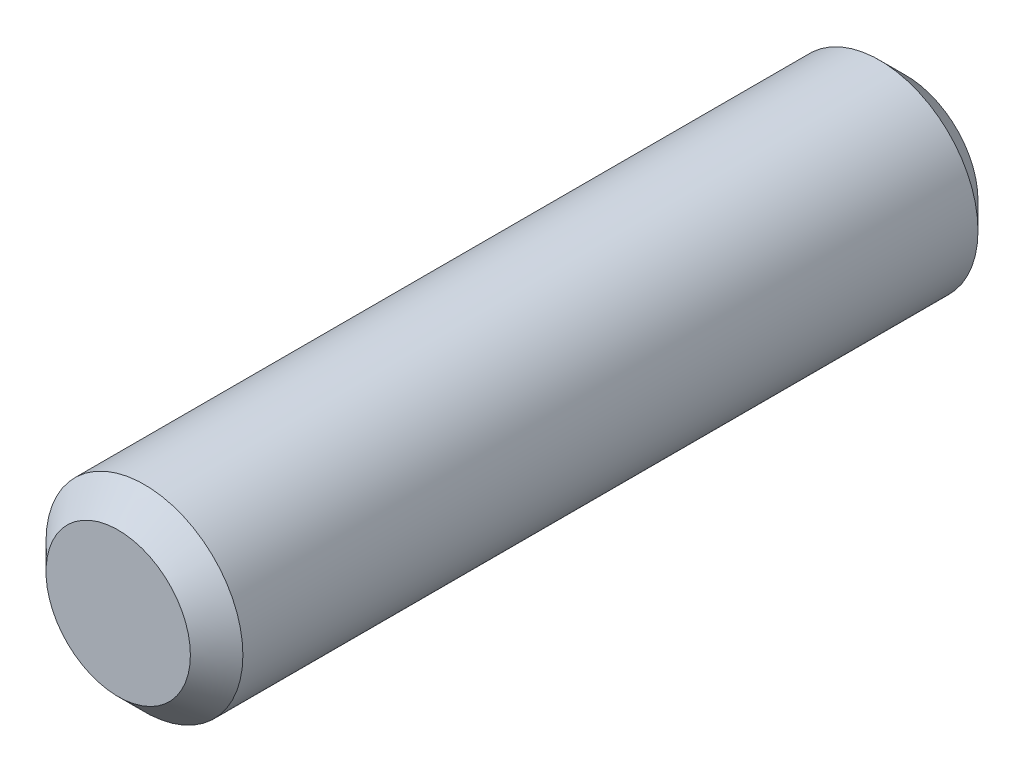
from build123d import *

# Parameters (mm, degrees)
ESQUISSE1_R          = 7.5
BASE_EXTRUSION_DEPTH = 30
CHANFREIN1_SIZE      = 2


with BuildPart() as part:
    # Esquisse1 → Base-Extrusion (new, symmetric)
    with BuildSketch(Plane.XY):
        Circle(ESQUISSE1_R)
    extrude(amount=BASE_EXTRUSION_DEPTH, both=True)

    # Chanfrein1
    chanfrein1_edges = [part.edges().sort_by_distance(p)[0] for p in [
        (-7.5, 0, -30),
        (-7.5, 0, 30),
    ]]
    chamfer(chanfrein1_edges, length=CHANFREIN1_SIZE)


solid = part.part
